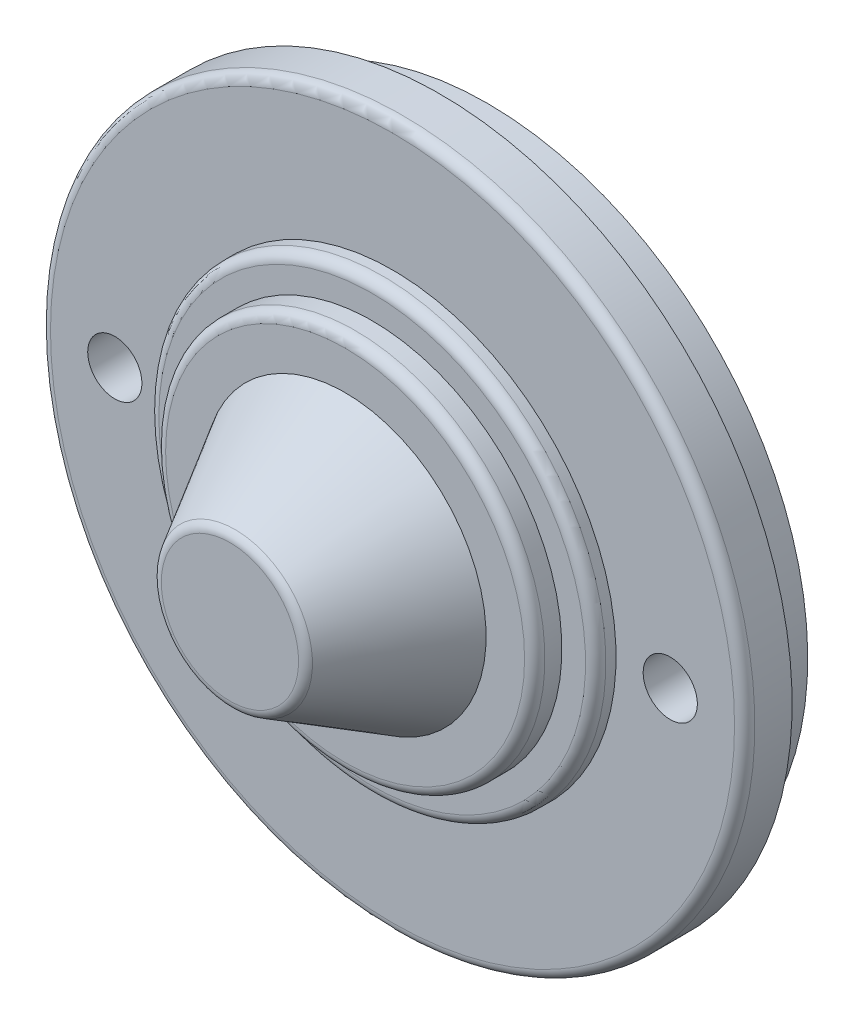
ISO-10303-21;
HEADER;
FILE_DESCRIPTION(('STEP AP214'),'2;1');
FILE_NAME('part.step','',(''),(''),'','','');
FILE_SCHEMA(('AUTOMOTIVE_DESIGN { 1 0 10303 214 1 1 1 1 }'));
ENDSEC;
DATA;
#1=APPLICATION_CONTEXT('core data for automotive mechanical design processes');
#2=APPLICATION_PROTOCOL_DEFINITION('international standard','automotive_design',2000,#1);
#3=PRODUCT_CONTEXT('',#1,'mechanical');
#4=PRODUCT('Part','Part','',(#3));
#5=PRODUCT_RELATED_PRODUCT_CATEGORY('part','',(#4));
#6=PRODUCT_DEFINITION_FORMATION('','',#4);
#7=PRODUCT_DEFINITION_CONTEXT('part definition',#1,'design');
#8=PRODUCT_DEFINITION('design','',#6,#7);
#9=PRODUCT_DEFINITION_SHAPE('','',#8);
#10=(LENGTH_UNIT() NAMED_UNIT(*) SI_UNIT(.MILLI.,.METRE.));
#11=(NAMED_UNIT(*) PLANE_ANGLE_UNIT() SI_UNIT($,.RADIAN.));
#12=(NAMED_UNIT(*) SI_UNIT($,.STERADIAN.) SOLID_ANGLE_UNIT());
#13=UNCERTAINTY_MEASURE_WITH_UNIT(LENGTH_MEASURE(1.E-05),#10,'distance_accuracy_value','');
#14=(GEOMETRIC_REPRESENTATION_CONTEXT(3) GLOBAL_UNCERTAINTY_ASSIGNED_CONTEXT((#13)) GLOBAL_UNIT_ASSIGNED_CONTEXT((#10,
#11,#12)) REPRESENTATION_CONTEXT('',''));
#15=CARTESIAN_POINT('',(0.,0.,0.));
#16=DIRECTION('',(0.,0.,1.));
#17=DIRECTION('',(1.,0.,0.));
#18=AXIS2_PLACEMENT_3D('',#15,#16,#17);
#19=CARTESIAN_POINT('',(0.,23.6383654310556,-29.0601226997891));
#20=DIRECTION('',(0.,0.,-1.));
#21=DIRECTION('',(-1.,0.,0.));
#22=AXIS2_PLACEMENT_3D('',#19,#20,#21);
#23=CYLINDRICAL_SURFACE('',#22,21.9500000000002);
#24=CARTESIAN_POINT('',(0.,23.6383654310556,-8.13632677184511));
#25=DIRECTION('',(0.,0.,-1.));
#26=DIRECTION('',(-1.,0.,0.));
#27=AXIS2_PLACEMENT_3D('',#24,#25,#26);
#28=CIRCLE('',#27,21.9500000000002);
#29=CARTESIAN_POINT('',(-21.7817682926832,26.3507573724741,-8.13632677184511));
#30=VERTEX_POINT('',#29);
#31=CARTESIAN_POINT('',(-21.6696573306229,27.1352856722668,-8.13632677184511));
#32=VERTEX_POINT('',#31);
#33=EDGE_CURVE('E155',#30,#32,#28,.T.);
#34=ORIENTED_EDGE('',*,*,#33,.T.);
#35=DIRECTION('',(0.,0.,-1.));
#36=VECTOR('',#35,1.);
#37=CARTESIAN_POINT('',(-21.6696573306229,27.1352856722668,-4.63632677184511));
#38=LINE('',#37,#36);
#39=CARTESIAN_POINT('',(-21.6696573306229,27.1352856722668,-4.63632677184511));
#40=VERTEX_POINT('',#39);
#41=EDGE_CURVE('E328',#40,#32,#38,.T.);
#42=ORIENTED_EDGE('',*,*,#41,.F.);
#43=CARTESIAN_POINT('',(0.,23.6383654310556,-4.63632677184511));
#44=DIRECTION('',(0.,0.,-1.));
#45=DIRECTION('',(-1.,0.,0.));
#46=AXIS2_PLACEMENT_3D('',#43,#44,#45);
#47=CIRCLE('',#46,21.9500000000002);
#48=CARTESIAN_POINT('',(-21.7817682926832,26.3507573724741,-4.63632677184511));
#49=VERTEX_POINT('',#48);
#50=EDGE_CURVE('E159',#49,#40,#47,.T.);
#51=ORIENTED_EDGE('',*,*,#50,.F.);
#52=DIRECTION('',(0.,0.,1.));
#53=VECTOR('',#52,1.);
#54=CARTESIAN_POINT('',(-21.7817682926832,26.3507573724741,-6.38632677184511));
#55=LINE('',#54,#53);
#56=EDGE_CURVE('E11',#30,#49,#55,.T.);
#57=ORIENTED_EDGE('',*,*,#56,.F.);
#58=EDGE_LOOP('',(#34,#42,#51,#57));
#59=FACE_BOUND('',#58,.T.);
#60=ADVANCED_FACE('F29',(#59),#23,.F.);
#61=DIRECTION('',(0.,0.,1.));
#62=VECTOR('',#61,1.);
#63=CARTESIAN_POINT('',(21.7817682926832,20.9259734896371,-6.38632677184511));
#64=LINE('',#63,#62);
#65=CARTESIAN_POINT('',(21.7817682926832,20.9259734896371,-8.13632677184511));
#66=VERTEX_POINT('',#65);
#67=CARTESIAN_POINT('',(21.7817682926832,20.9259734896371,-4.63632677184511));
#68=VERTEX_POINT('',#67);
#69=EDGE_CURVE('E145',#66,#68,#64,.T.);
#70=ORIENTED_EDGE('',*,*,#69,.F.);
#71=CARTESIAN_POINT('',(-21.7817682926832,20.9259734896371,-8.13632677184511));
#72=VERTEX_POINT('',#71);
#73=EDGE_CURVE('E154',#66,#72,#28,.T.);
#74=ORIENTED_EDGE('',*,*,#73,.T.);
#75=DIRECTION('',(0.,0.,1.));
#76=VECTOR('',#75,1.);
#77=CARTESIAN_POINT('',(-21.7817682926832,20.9259734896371,-6.38632677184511));
#78=LINE('',#77,#76);
#79=CARTESIAN_POINT('',(-21.7817682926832,20.9259734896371,-4.63632677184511));
#80=VERTEX_POINT('',#79);
#81=EDGE_CURVE('E38',#80,#72,#78,.F.);
#82=ORIENTED_EDGE('',*,*,#81,.F.);
#83=EDGE_CURVE('E158',#68,#80,#47,.T.);
#84=ORIENTED_EDGE('',*,*,#83,.F.);
#85=EDGE_LOOP('',(#70,#74,#82,#84));
#86=FACE_BOUND('',#85,.T.);
#87=ADVANCED_FACE('F302',(#86),#23,.F.);
#88=CARTESIAN_POINT('',(-20.020052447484,32.6383654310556,-4.63632677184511));
#89=VERTEX_POINT('',#88);
#90=CARTESIAN_POINT('',(21.7817682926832,26.3507573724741,-4.63632677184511));
#91=VERTEX_POINT('',#90);
#92=EDGE_CURVE('E162',#89,#91,#47,.T.);
#93=ORIENTED_EDGE('',*,*,#92,.F.);
#94=DIRECTION('',(0.,0.,-1.));
#95=VECTOR('',#94,1.);
#96=CARTESIAN_POINT('',(-20.020052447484,32.6383654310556,-4.63632677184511));
#97=LINE('',#96,#95);
#98=CARTESIAN_POINT('',(-20.020052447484,32.6383654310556,-8.13632677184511));
#99=VERTEX_POINT('',#98);
#100=EDGE_CURVE('E105',#89,#99,#97,.T.);
#101=ORIENTED_EDGE('',*,*,#100,.T.);
#102=CARTESIAN_POINT('',(21.7817682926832,26.3507573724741,-8.13632677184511));
#103=VERTEX_POINT('',#102);
#104=EDGE_CURVE('E113',#99,#103,#28,.T.);
#105=ORIENTED_EDGE('',*,*,#104,.T.);
#106=DIRECTION('',(0.,0.,1.));
#107=VECTOR('',#106,1.);
#108=CARTESIAN_POINT('',(21.7817682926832,26.3507573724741,-6.38632677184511));
#109=LINE('',#108,#107);
#110=EDGE_CURVE('E142',#91,#103,#109,.F.);
#111=ORIENTED_EDGE('',*,*,#110,.F.);
#112=EDGE_LOOP('',(#93,#101,#105,#111));
#113=FACE_BOUND('',#112,.T.);
#114=ADVANCED_FACE('F305',(#113),#23,.F.);
#115=CARTESIAN_POINT('',(0.,47.2883654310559,-8.13632677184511));
#116=DIRECTION('',(0.,0.,1.));
#117=DIRECTION('',(1.,0.,0.));
#118=AXIS2_PLACEMENT_3D('',#115,#116,#117);
#119=PLANE('',#118);
#120=CARTESIAN_POINT('',(20.5,23.6383654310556,-8.13632677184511));
#121=DIRECTION('',(0.,0.,-1.));
#122=DIRECTION('',(-1.,0.,0.));
#123=AXIS2_PLACEMENT_3D('',#120,#121,#122);
#124=CIRCLE('',#123,2.00000000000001);
#125=CARTESIAN_POINT('',(18.5,23.6383654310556,-8.13632677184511));
#126=VERTEX_POINT('',#125);
#127=EDGE_CURVE('E138',#126,#126,#124,.T.);
#128=ORIENTED_EDGE('',*,*,#127,.F.);
#129=EDGE_LOOP('',(#128));
#130=FACE_BOUND('',#129,.T.);
#131=CARTESIAN_POINT('',(-20.5,23.6383654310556,-8.13632677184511));
#132=DIRECTION('',(0.,0.,-1.));
#133=DIRECTION('',(-1.,0.,0.));
#134=AXIS2_PLACEMENT_3D('',#131,#132,#133);
#135=CIRCLE('',#134,2.);
#136=CARTESIAN_POINT('',(-22.5,23.6383654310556,-8.13632677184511));
#137=VERTEX_POINT('',#136);
#138=EDGE_CURVE('E128',#137,#137,#135,.T.);
#139=ORIENTED_EDGE('',*,*,#138,.F.);
#140=EDGE_LOOP('',(#139));
#141=FACE_BOUND('',#140,.T.);
#142=CARTESIAN_POINT('',(0.,23.6383654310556,-8.13632677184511));
#143=DIRECTION('',(0.,0.,-1.));
#144=DIRECTION('',(-1.,0.,0.));
#145=AXIS2_PLACEMENT_3D('',#142,#143,#144);
#146=CIRCLE('',#145,23.6500000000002);
#147=CARTESIAN_POINT('',(-21.8705852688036,32.6383654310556,-8.13632677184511));
#148=VERTEX_POINT('',#147);
#149=CARTESIAN_POINT('',(-23.3092792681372,27.6383654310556,-8.13632677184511));
#150=VERTEX_POINT('',#149);
#151=EDGE_CURVE('E111',#148,#150,#146,.T.);
#152=ORIENTED_EDGE('',*,*,#151,.T.);
#153=DIRECTION('',(-0.956011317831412,0.293329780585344,0.));
#154=VECTOR('',#153,1.);
#155=CARTESIAN_POINT('',(-23.3092792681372,27.6383654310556,-8.13632677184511));
#156=LINE('',#155,#154);
#157=EDGE_CURVE('E114',#32,#150,#156,.T.);
#158=ORIENTED_EDGE('',*,*,#157,.F.);
#159=ORIENTED_EDGE('',*,*,#33,.F.);
#160=CARTESIAN_POINT('',(-20.5,23.6383654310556,-8.13632677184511));
#161=DIRECTION('',(0.,0.,-1.));
#162=DIRECTION('',(-1.,0.,0.));
#163=AXIS2_PLACEMENT_3D('',#160,#161,#162);
#164=CIRCLE('',#163,3.);
#165=EDGE_CURVE('E151',#30,#72,#164,.T.);
#166=ORIENTED_EDGE('',*,*,#165,.T.);
#167=ORIENTED_EDGE('',*,*,#73,.F.);
#168=CARTESIAN_POINT('',(20.5,23.6383654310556,-8.13632677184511));
#169=DIRECTION('',(0.,0.,-1.));
#170=DIRECTION('',(-1.,0.,0.));
#171=AXIS2_PLACEMENT_3D('',#168,#169,#170);
#172=CIRCLE('',#171,2.99999999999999);
#173=EDGE_CURVE('E131',#66,#103,#172,.T.);
#174=ORIENTED_EDGE('',*,*,#173,.T.);
#175=ORIENTED_EDGE('',*,*,#104,.F.);
#176=DIRECTION('',(1.,0.,0.));
#177=VECTOR('',#176,1.);
#178=CARTESIAN_POINT('',(-21.8705852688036,32.6383654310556,-8.13632677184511));
#179=LINE('',#178,#177);
#180=EDGE_CURVE('E98',#148,#99,#179,.T.);
#181=ORIENTED_EDGE('',*,*,#180,.F.);
#182=EDGE_LOOP('',(#152,#158,#159,#166,#167,#174,#175,#181));
#183=FACE_BOUND('',#182,.T.);
#184=ADVANCED_FACE('F31',(#130,#141,#183),#119,.F.);
#185=CARTESIAN_POINT('',(0.,23.6383654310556,-29.0601226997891));
#186=DIRECTION('',(0.,0.,-1.));
#187=DIRECTION('',(-1.,0.,0.));
#188=AXIS2_PLACEMENT_3D('',#185,#186,#187);
#189=CYLINDRICAL_SURFACE('',#188,23.6500000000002);
#190=CARTESIAN_POINT('',(0.,23.6383654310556,-4.63632677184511));
#191=DIRECTION('',(0.,0.,-1.));
#192=DIRECTION('',(-1.,0.,0.));
#193=AXIS2_PLACEMENT_3D('',#190,#191,#192);
#194=CIRCLE('',#193,23.6500000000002);
#195=CARTESIAN_POINT('',(-21.8705852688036,32.6383654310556,-4.63632677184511));
#196=VERTEX_POINT('',#195);
#197=CARTESIAN_POINT('',(-23.3092792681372,27.6383654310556,-4.63632677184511));
#198=VERTEX_POINT('',#197);
#199=EDGE_CURVE('E119',#196,#198,#194,.T.);
#200=ORIENTED_EDGE('',*,*,#199,.T.);
#201=DIRECTION('',(0.,0.,-1.));
#202=VECTOR('',#201,1.);
#203=CARTESIAN_POINT('',(-23.3092792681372,27.6383654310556,-4.63632677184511));
#204=LINE('',#203,#202);
#205=EDGE_CURVE('E118',#198,#150,#204,.T.);
#206=ORIENTED_EDGE('',*,*,#205,.T.);
#207=ORIENTED_EDGE('',*,*,#151,.F.);
#208=DIRECTION('',(0.,0.,-1.));
#209=VECTOR('',#208,1.);
#210=CARTESIAN_POINT('',(-21.8705852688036,32.6383654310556,-4.63632677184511));
#211=LINE('',#210,#209);
#212=EDGE_CURVE('E95',#196,#148,#211,.T.);
#213=ORIENTED_EDGE('',*,*,#212,.F.);
#214=EDGE_LOOP('',(#200,#206,#207,#213));
#215=FACE_BOUND('',#214,.T.);
#216=ADVANCED_FACE('F117',(#215),#189,.T.);
#217=CARTESIAN_POINT('',(0.,47.2883654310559,-4.63632677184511));
#218=DIRECTION('',(0.,0.,1.));
#219=DIRECTION('',(1.,0.,0.));
#220=AXIS2_PLACEMENT_3D('',#217,#218,#219);
#221=PLANE('',#220);
#222=ORIENTED_EDGE('',*,*,#199,.F.);
#223=DIRECTION('',(1.,0.,0.));
#224=VECTOR('',#223,1.);
#225=CARTESIAN_POINT('',(-21.8705852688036,32.6383654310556,-4.63632677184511));
#226=LINE('',#225,#224);
#227=EDGE_CURVE('E101',#196,#89,#226,.T.);
#228=ORIENTED_EDGE('',*,*,#227,.T.);
#229=ORIENTED_EDGE('',*,*,#92,.T.);
#230=CARTESIAN_POINT('',(20.5,23.6383654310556,-4.63632677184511));
#231=DIRECTION('',(0.,0.,-1.));
#232=DIRECTION('',(-1.,0.,0.));
#233=AXIS2_PLACEMENT_3D('',#230,#231,#232);
#234=CIRCLE('',#233,2.99999999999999);
#235=EDGE_CURVE('E53',#68,#91,#234,.T.);
#236=ORIENTED_EDGE('',*,*,#235,.F.);
#237=ORIENTED_EDGE('',*,*,#83,.T.);
#238=CARTESIAN_POINT('',(-20.5,23.6383654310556,-4.63632677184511));
#239=DIRECTION('',(0.,0.,-1.));
#240=DIRECTION('',(-1.,0.,0.));
#241=AXIS2_PLACEMENT_3D('',#238,#239,#240);
#242=CIRCLE('',#241,3.);
#243=EDGE_CURVE('E148',#49,#80,#242,.T.);
#244=ORIENTED_EDGE('',*,*,#243,.F.);
#245=ORIENTED_EDGE('',*,*,#50,.T.);
#246=DIRECTION('',(-0.956011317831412,0.293329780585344,0.));
#247=VECTOR('',#246,1.);
#248=CARTESIAN_POINT('',(-23.3092792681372,27.6383654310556,-4.63632677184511));
#249=LINE('',#248,#247);
#250=EDGE_CURVE('E46',#40,#198,#249,.T.);
#251=ORIENTED_EDGE('',*,*,#250,.T.);
#252=EDGE_LOOP('',(#222,#228,#229,#236,#237,#244,#245,#251));
#253=FACE_BOUND('',#252,.T.);
#254=CARTESIAN_POINT('',(0.,23.6383654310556,-4.63632677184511));
#255=DIRECTION('',(0.,0.,-1.));
#256=DIRECTION('',(-1.,0.,0.));
#257=AXIS2_PLACEMENT_3D('',#254,#255,#256);
#258=CIRCLE('',#257,25.9980881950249);
#259=CARTESIAN_POINT('',(-25.9980881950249,23.6383654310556,-4.63632677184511));
#260=VERTEX_POINT('',#259);
#261=EDGE_CURVE('E123',#260,#260,#258,.T.);
#262=ORIENTED_EDGE('',*,*,#261,.T.);
#263=EDGE_LOOP('',(#262));
#264=FACE_BOUND('',#263,.T.);
#265=CARTESIAN_POINT('',(0.,23.6383654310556,-4.63632677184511));
#266=DIRECTION('',(0.,0.,-1.));
#267=DIRECTION('',(-1.,0.,0.));
#268=AXIS2_PLACEMENT_3D('',#265,#266,#267);
#269=CIRCLE('',#268,16.);
#270=CARTESIAN_POINT('',(-16.,23.6383654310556,-4.63632677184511));
#271=VERTEX_POINT('',#270);
#272=EDGE_CURVE('E161',#271,#271,#269,.T.);
#273=ORIENTED_EDGE('',*,*,#272,.F.);
#274=EDGE_LOOP('',(#273));
#275=FACE_BOUND('',#274,.T.);
#276=ADVANCED_FACE('F221',(#253,#264,#275),#221,.F.);
#277=CARTESIAN_POINT('',(0.,23.6383654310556,-29.0601226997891));
#278=DIRECTION('',(0.,0.,-1.));
#279=DIRECTION('',(-1.,0.,0.));
#280=AXIS2_PLACEMENT_3D('',#277,#278,#279);
#281=CYLINDRICAL_SURFACE('',#280,25.9980881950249);
#282=ORIENTED_EDGE('',*,*,#261,.F.);
#283=EDGE_LOOP('',(#282));
#284=FACE_BOUND('',#283,.T.);
#285=CARTESIAN_POINT('',(0.,23.6383654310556,-1.88632677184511));
#286=DIRECTION('',(0.,0.,-1.));
#287=DIRECTION('',(-1.,0.,0.));
#288=AXIS2_PLACEMENT_3D('',#285,#286,#287);
#289=CIRCLE('',#288,25.9980881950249);
#290=CARTESIAN_POINT('',(-25.9980881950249,23.6383654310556,-1.88632677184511));
#291=VERTEX_POINT('',#290);
#292=EDGE_CURVE('E216',#291,#291,#289,.T.);
#293=ORIENTED_EDGE('',*,*,#292,.T.);
#294=EDGE_LOOP('',(#293));
#295=FACE_BOUND('',#294,.T.);
#296=ADVANCED_FACE('F224',(#284,#295),#281,.T.);
#297=CARTESIAN_POINT('',(0.,23.6383654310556,-1.88632677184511));
#298=DIRECTION('',(0.,0.,-1.));
#299=DIRECTION('',(-1.,0.,0.));
#300=AXIS2_PLACEMENT_3D('',#297,#298,#299);
#301=TOROIDAL_SURFACE('',#300,25.2480881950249,0.749999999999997);
#302=ORIENTED_EDGE('',*,*,#292,.F.);
#303=EDGE_LOOP('',(#302));
#304=FACE_BOUND('',#303,.T.);
#305=CARTESIAN_POINT('',(0.,23.6383654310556,-1.13632677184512));
#306=DIRECTION('',(0.,0.,-1.));
#307=DIRECTION('',(-1.,0.,0.));
#308=AXIS2_PLACEMENT_3D('',#305,#306,#307);
#309=CIRCLE('',#308,25.2480881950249);
#310=CARTESIAN_POINT('',(-25.2480881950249,23.6383654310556,-1.13632677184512));
#311=VERTEX_POINT('',#310);
#312=EDGE_CURVE('E213',#311,#311,#309,.T.);
#313=ORIENTED_EDGE('',*,*,#312,.T.);
#314=EDGE_LOOP('',(#313));
#315=FACE_BOUND('',#314,.T.);
#316=ADVANCED_FACE('F227',(#304,#315),#301,.T.);
#317=CARTESIAN_POINT('',(0.,48.8864536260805,-1.13632677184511));
#318=DIRECTION('',(0.,0.,-1.));
#319=DIRECTION('',(-1.,0.,0.));
#320=AXIS2_PLACEMENT_3D('',#317,#318,#319);
#321=PLANE('',#320);
#322=CARTESIAN_POINT('',(20.5,23.6383654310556,-1.13632677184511));
#323=DIRECTION('',(0.,0.,-1.));
#324=DIRECTION('',(-1.,0.,0.));
#325=AXIS2_PLACEMENT_3D('',#322,#323,#324);
#326=CIRCLE('',#325,2.00000000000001);
#327=CARTESIAN_POINT('',(18.5,23.6383654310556,-1.13632677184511));
#328=VERTEX_POINT('',#327);
#329=EDGE_CURVE('E33',#328,#328,#326,.T.);
#330=ORIENTED_EDGE('',*,*,#329,.T.);
#331=EDGE_LOOP('',(#330));
#332=FACE_BOUND('',#331,.T.);
#333=CARTESIAN_POINT('',(-20.5,23.6383654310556,-1.13632677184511));
#334=DIRECTION('',(0.,0.,-1.));
#335=DIRECTION('',(-1.,0.,0.));
#336=AXIS2_PLACEMENT_3D('',#333,#334,#335);
#337=CIRCLE('',#336,2.);
#338=CARTESIAN_POINT('',(-22.5,23.6383654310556,-1.13632677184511));
#339=VERTEX_POINT('',#338);
#340=EDGE_CURVE('E126',#339,#339,#337,.T.);
#341=ORIENTED_EDGE('',*,*,#340,.T.);
#342=EDGE_LOOP('',(#341));
#343=FACE_BOUND('',#342,.T.);
#344=ORIENTED_EDGE('',*,*,#312,.F.);
#345=EDGE_LOOP('',(#344));
#346=FACE_BOUND('',#345,.T.);
#347=CARTESIAN_POINT('',(0.,23.6383654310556,-1.13632677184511));
#348=DIRECTION('',(0.,0.,-1.));
#349=DIRECTION('',(-1.,0.,0.));
#350=AXIS2_PLACEMENT_3D('',#347,#348,#349);
#351=CIRCLE('',#350,16.5);
#352=CARTESIAN_POINT('',(-16.5,23.6383654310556,-1.13632677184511));
#353=VERTEX_POINT('',#352);
#354=EDGE_CURVE('E210',#353,#353,#351,.T.);
#355=ORIENTED_EDGE('',*,*,#354,.T.);
#356=EDGE_LOOP('',(#355));
#357=FACE_BOUND('',#356,.T.);
#358=ADVANCED_FACE('F233',(#332,#343,#346,#357),#321,.F.);
#359=CARTESIAN_POINT('',(0.,23.6383654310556,-29.0601226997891));
#360=DIRECTION('',(0.,0.,-1.));
#361=DIRECTION('',(-1.,0.,0.));
#362=AXIS2_PLACEMENT_3D('',#359,#360,#361);
#363=CYLINDRICAL_SURFACE('',#362,16.5);
#364=ORIENTED_EDGE('',*,*,#354,.F.);
#365=EDGE_LOOP('',(#364));
#366=FACE_BOUND('',#365,.T.);
#367=CARTESIAN_POINT('',(0.,23.6383654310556,-0.386326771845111));
#368=DIRECTION('',(0.,0.,-1.));
#369=DIRECTION('',(-1.,0.,0.));
#370=AXIS2_PLACEMENT_3D('',#367,#368,#369);
#371=CIRCLE('',#370,16.5);
#372=CARTESIAN_POINT('',(-16.5,23.6383654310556,-0.386326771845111));
#373=VERTEX_POINT('',#372);
#374=EDGE_CURVE('E207',#373,#373,#371,.T.);
#375=ORIENTED_EDGE('',*,*,#374,.T.);
#376=EDGE_LOOP('',(#375));
#377=FACE_BOUND('',#376,.T.);
#378=ADVANCED_FACE('F239',(#366,#377),#363,.T.);
#379=CARTESIAN_POINT('',(0.,23.6383654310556,-0.386326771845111));
#380=DIRECTION('',(0.,0.,-1.));
#381=DIRECTION('',(-1.,0.,0.));
#382=AXIS2_PLACEMENT_3D('',#379,#380,#381);
#383=TOROIDAL_SURFACE('',#382,15.75,0.75);
#384=ORIENTED_EDGE('',*,*,#374,.F.);
#385=EDGE_LOOP('',(#384));
#386=FACE_BOUND('',#385,.T.);
#387=CARTESIAN_POINT('',(0.,23.6383654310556,0.363673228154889));
#388=DIRECTION('',(0.,0.,-1.));
#389=DIRECTION('',(-1.,0.,0.));
#390=AXIS2_PLACEMENT_3D('',#387,#388,#389);
#391=CIRCLE('',#390,15.75);
#392=CARTESIAN_POINT('',(-15.75,23.6383654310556,0.363673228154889));
#393=VERTEX_POINT('',#392);
#394=EDGE_CURVE('E204',#393,#393,#391,.T.);
#395=ORIENTED_EDGE('',*,*,#394,.T.);
#396=EDGE_LOOP('',(#395));
#397=FACE_BOUND('',#396,.T.);
#398=ADVANCED_FACE('F246',(#386,#397),#383,.T.);
#399=CARTESIAN_POINT('',(0.,39.3883654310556,0.36367322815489));
#400=DIRECTION('',(0.,0.,-1.));
#401=DIRECTION('',(-1.,0.,0.));
#402=AXIS2_PLACEMENT_3D('',#399,#400,#401);
#403=PLANE('',#402);
#404=ORIENTED_EDGE('',*,*,#394,.F.);
#405=EDGE_LOOP('',(#404));
#406=FACE_BOUND('',#405,.T.);
#407=CARTESIAN_POINT('',(0.,23.6383654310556,0.363673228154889));
#408=DIRECTION('',(0.,0.,-1.));
#409=DIRECTION('',(-1.,0.,0.));
#410=AXIS2_PLACEMENT_3D('',#407,#408,#409);
#411=CIRCLE('',#410,14.);
#412=CARTESIAN_POINT('',(-14.,23.6383654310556,0.363673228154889));
#413=VERTEX_POINT('',#412);
#414=EDGE_CURVE('E201',#413,#413,#411,.T.);
#415=ORIENTED_EDGE('',*,*,#414,.T.);
#416=EDGE_LOOP('',(#415));
#417=FACE_BOUND('',#416,.T.);
#418=ADVANCED_FACE('F252',(#406,#417),#403,.F.);
#419=CARTESIAN_POINT('',(0.,23.6383654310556,-29.0601226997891));
#420=DIRECTION('',(0.,0.,-1.));
#421=DIRECTION('',(-1.,0.,0.));
#422=AXIS2_PLACEMENT_3D('',#419,#420,#421);
#423=CYLINDRICAL_SURFACE('',#422,14.);
#424=ORIENTED_EDGE('',*,*,#414,.F.);
#425=EDGE_LOOP('',(#424));
#426=FACE_BOUND('',#425,.T.);
#427=CARTESIAN_POINT('',(0.,23.6383654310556,1.61367322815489));
#428=DIRECTION('',(0.,0.,-1.));
#429=DIRECTION('',(-1.,0.,0.));
#430=AXIS2_PLACEMENT_3D('',#427,#428,#429);
#431=CIRCLE('',#430,14.);
#432=CARTESIAN_POINT('',(-14.,23.6383654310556,1.61367322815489));
#433=VERTEX_POINT('',#432);
#434=EDGE_CURVE('E198',#433,#433,#431,.T.);
#435=ORIENTED_EDGE('',*,*,#434,.T.);
#436=EDGE_LOOP('',(#435));
#437=FACE_BOUND('',#436,.T.);
#438=ADVANCED_FACE('F258',(#426,#437),#423,.T.);
#439=CARTESIAN_POINT('',(0.,23.6383654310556,1.61367322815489));
#440=DIRECTION('',(0.,0.,-1.));
#441=DIRECTION('',(-1.,0.,0.));
#442=AXIS2_PLACEMENT_3D('',#439,#440,#441);
#443=TOROIDAL_SURFACE('',#442,13.25,0.749999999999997);
#444=ORIENTED_EDGE('',*,*,#434,.F.);
#445=EDGE_LOOP('',(#444));
#446=FACE_BOUND('',#445,.T.);
#447=CARTESIAN_POINT('',(0.,23.6383654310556,2.36367322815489));
#448=DIRECTION('',(0.,0.,-1.));
#449=DIRECTION('',(-1.,0.,0.));
#450=AXIS2_PLACEMENT_3D('',#447,#448,#449);
#451=CIRCLE('',#450,13.25);
#452=CARTESIAN_POINT('',(-13.25,23.6383654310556,2.36367322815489));
#453=VERTEX_POINT('',#452);
#454=EDGE_CURVE('E195',#453,#453,#451,.T.);
#455=ORIENTED_EDGE('',*,*,#454,.T.);
#456=EDGE_LOOP('',(#455));
#457=FACE_BOUND('',#456,.T.);
#458=ADVANCED_FACE('F264',(#446,#457),#443,.T.);
#459=CARTESIAN_POINT('',(0.,36.8883654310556,2.36367322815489));
#460=DIRECTION('',(0.,0.,-1.));
#461=DIRECTION('',(-1.,0.,0.));
#462=AXIS2_PLACEMENT_3D('',#459,#460,#461);
#463=PLANE('',#462);
#464=ORIENTED_EDGE('',*,*,#454,.F.);
#465=EDGE_LOOP('',(#464));
#466=FACE_BOUND('',#465,.T.);
#467=CARTESIAN_POINT('',(0.,23.6383654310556,2.36367322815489));
#468=DIRECTION('',(0.,0.,-1.));
#469=DIRECTION('',(-1.,0.,0.));
#470=AXIS2_PLACEMENT_3D('',#467,#468,#469);
#471=CIRCLE('',#470,10.4074772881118);
#472=CARTESIAN_POINT('',(-10.4074772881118,23.6383654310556,2.36367322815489));
#473=VERTEX_POINT('',#472);
#474=EDGE_CURVE('E192',#473,#473,#471,.T.);
#475=ORIENTED_EDGE('',*,*,#474,.T.);
#476=EDGE_LOOP('',(#475));
#477=FACE_BOUND('',#476,.T.);
#478=ADVANCED_FACE('F270',(#466,#477),#463,.F.);
#479=CARTESIAN_POINT('',(0.,23.6383654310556,10.4886732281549));
#480=DIRECTION('',(0.,0.,-1.));
#481=DIRECTION('',(-1.,0.,0.));
#482=AXIS2_PLACEMENT_3D('',#479,#480,#481);
#483=CONICAL_SURFACE('',#482,5.71650635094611,0.5235987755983);
#484=ORIENTED_EDGE('',*,*,#474,.F.);
#485=EDGE_LOOP('',(#484));
#486=FACE_BOUND('',#485,.T.);
#487=CARTESIAN_POINT('',(0.,23.6383654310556,10.4886732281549));
#488=DIRECTION('',(0.,0.,-1.));
#489=DIRECTION('',(-1.,0.,0.));
#490=AXIS2_PLACEMENT_3D('',#487,#488,#489);
#491=CIRCLE('',#490,5.71650635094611);
#492=CARTESIAN_POINT('',(-5.71650635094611,23.6383654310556,10.4886732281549));
#493=VERTEX_POINT('',#492);
#494=EDGE_CURVE('E189',#493,#493,#491,.T.);
#495=ORIENTED_EDGE('',*,*,#494,.T.);
#496=EDGE_LOOP('',(#495));
#497=FACE_BOUND('',#496,.T.);
#498=ADVANCED_FACE('F276',(#486,#497),#483,.T.);
#499=CARTESIAN_POINT('',(0.,23.6383654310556,10.1136732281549));
#500=DIRECTION('',(0.,0.,-1.));
#501=DIRECTION('',(-1.,0.,0.));
#502=AXIS2_PLACEMENT_3D('',#499,#500,#501);
#503=TOROIDAL_SURFACE('',#502,5.06698729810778,0.749999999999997);
#504=ORIENTED_EDGE('',*,*,#494,.F.);
#505=EDGE_LOOP('',(#504));
#506=FACE_BOUND('',#505,.T.);
#507=CARTESIAN_POINT('',(0.,23.6383654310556,10.8636732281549));
#508=DIRECTION('',(0.,0.,-1.));
#509=DIRECTION('',(-1.,0.,0.));
#510=AXIS2_PLACEMENT_3D('',#507,#508,#509);
#511=CIRCLE('',#510,5.06698729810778);
#512=CARTESIAN_POINT('',(-5.06698729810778,23.6383654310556,10.8636732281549));
#513=VERTEX_POINT('',#512);
#514=EDGE_CURVE('E186',#513,#513,#511,.T.);
#515=ORIENTED_EDGE('',*,*,#514,.T.);
#516=EDGE_LOOP('',(#515));
#517=FACE_BOUND('',#516,.T.);
#518=ADVANCED_FACE('F282',(#506,#517),#503,.T.);
#519=CARTESIAN_POINT('',(0.,28.7053527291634,10.8636732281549));
#520=DIRECTION('',(0.,0.,-1.));
#521=DIRECTION('',(-1.,0.,0.));
#522=AXIS2_PLACEMENT_3D('',#519,#520,#521);
#523=PLANE('',#522);
#524=ORIENTED_EDGE('',*,*,#514,.F.);
#525=EDGE_LOOP('',(#524));
#526=FACE_BOUND('',#525,.T.);
#527=ADVANCED_FACE('F288',(#526),#523,.F.);
#528=CARTESIAN_POINT('',(0.,27.9063146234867,8.56367322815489));
#529=DIRECTION('',(0.,0.,1.));
#530=DIRECTION('',(1.,0.,0.));
#531=AXIS2_PLACEMENT_3D('',#528,#529,#530);
#532=PLANE('',#531);
#533=CARTESIAN_POINT('',(0.,23.6383654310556,8.56367322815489));
#534=DIRECTION('',(0.,0.,-1.));
#535=DIRECTION('',(-1.,0.,0.));
#536=AXIS2_PLACEMENT_3D('',#533,#534,#535);
#537=CIRCLE('',#536,4.26794919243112);
#538=CARTESIAN_POINT('',(-4.26794919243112,23.6383654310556,8.56367322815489));
#539=VERTEX_POINT('',#538);
#540=EDGE_CURVE('E183',#539,#539,#537,.T.);
#541=ORIENTED_EDGE('',*,*,#540,.T.);
#542=EDGE_LOOP('',(#541));
#543=FACE_BOUND('',#542,.T.);
#544=ADVANCED_FACE('F293',(#543),#532,.F.);
#545=CARTESIAN_POINT('',(0.,23.6383654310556,5.56367322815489));
#546=DIRECTION('',(0.,0.,-1.));
#547=DIRECTION('',(-1.,0.,0.));
#548=AXIS2_PLACEMENT_3D('',#545,#546,#547);
#549=CONICAL_SURFACE('',#548,6.,0.5235987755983);
#550=ORIENTED_EDGE('',*,*,#540,.F.);
#551=EDGE_LOOP('',(#550));
#552=FACE_BOUND('',#551,.T.);
#553=CARTESIAN_POINT('',(0.,23.6383654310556,5.56367322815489));
#554=DIRECTION('',(0.,0.,-1.));
#555=DIRECTION('',(-1.,0.,0.));
#556=AXIS2_PLACEMENT_3D('',#553,#554,#555);
#557=CIRCLE('',#556,6.);
#558=CARTESIAN_POINT('',(-6.,23.6383654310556,5.56367322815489));
#559=VERTEX_POINT('',#558);
#560=EDGE_CURVE('E180',#559,#559,#557,.T.);
#561=ORIENTED_EDGE('',*,*,#560,.T.);
#562=EDGE_LOOP('',(#561));
#563=FACE_BOUND('',#562,.T.);
#564=ADVANCED_FACE('F298',(#552,#563),#549,.F.);
#565=CARTESIAN_POINT('',(0.,23.6383654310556,-29.0601226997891));
#566=DIRECTION('',(0.,0.,-1.));
#567=DIRECTION('',(-1.,0.,0.));
#568=AXIS2_PLACEMENT_3D('',#565,#566,#567);
#569=CYLINDRICAL_SURFACE('',#568,6.);
#570=ORIENTED_EDGE('',*,*,#560,.F.);
#571=EDGE_LOOP('',(#570));
#572=FACE_BOUND('',#571,.T.);
#573=CARTESIAN_POINT('',(0.,23.6383654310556,-3.43632677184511));
#574=DIRECTION('',(0.,0.,-1.));
#575=DIRECTION('',(-1.,0.,0.));
#576=AXIS2_PLACEMENT_3D('',#573,#574,#575);
#577=CIRCLE('',#576,6.);
#578=CARTESIAN_POINT('',(-6.,23.6383654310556,-3.43632677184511));
#579=VERTEX_POINT('',#578);
#580=EDGE_CURVE('E177',#579,#579,#577,.T.);
#581=ORIENTED_EDGE('',*,*,#580,.T.);
#582=EDGE_LOOP('',(#581));
#583=FACE_BOUND('',#582,.T.);
#584=ADVANCED_FACE('F470',(#572,#583),#569,.F.);
#585=CARTESIAN_POINT('',(0.,37.1383654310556,-3.43632677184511));
#586=DIRECTION('',(0.,0.,1.));
#587=DIRECTION('',(1.,0.,0.));
#588=AXIS2_PLACEMENT_3D('',#585,#586,#587);
#589=PLANE('',#588);
#590=ORIENTED_EDGE('',*,*,#580,.F.);
#591=EDGE_LOOP('',(#590));
#592=FACE_BOUND('',#591,.T.);
#593=CARTESIAN_POINT('',(0.,23.6383654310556,-3.43632677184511));
#594=DIRECTION('',(0.,0.,-1.));
#595=DIRECTION('',(-1.,0.,0.));
#596=AXIS2_PLACEMENT_3D('',#593,#594,#595);
#597=CIRCLE('',#596,13.5);
#598=CARTESIAN_POINT('',(-13.5,23.6383654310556,-3.43632677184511));
#599=VERTEX_POINT('',#598);
#600=EDGE_CURVE('E174',#599,#599,#597,.T.);
#601=ORIENTED_EDGE('',*,*,#600,.T.);
#602=EDGE_LOOP('',(#601));
#603=FACE_BOUND('',#602,.T.);
#604=ADVANCED_FACE('F480',(#592,#603),#589,.F.);
#605=CARTESIAN_POINT('',(0.,23.6383654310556,-29.0601226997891));
#606=DIRECTION('',(0.,0.,-1.));
#607=DIRECTION('',(-1.,0.,0.));
#608=AXIS2_PLACEMENT_3D('',#605,#606,#607);
#609=CYLINDRICAL_SURFACE('',#608,13.5);
#610=ORIENTED_EDGE('',*,*,#600,.F.);
#611=EDGE_LOOP('',(#610));
#612=FACE_BOUND('',#611,.T.);
#613=CARTESIAN_POINT('',(0.,23.6383654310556,-6.83632677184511));
#614=DIRECTION('',(0.,0.,-1.));
#615=DIRECTION('',(-1.,0.,0.));
#616=AXIS2_PLACEMENT_3D('',#613,#614,#615);
#617=CIRCLE('',#616,13.5);
#618=CARTESIAN_POINT('',(-13.5,23.6383654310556,-6.83632677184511));
#619=VERTEX_POINT('',#618);
#620=EDGE_CURVE('E171',#619,#619,#617,.T.);
#621=ORIENTED_EDGE('',*,*,#620,.T.);
#622=EDGE_LOOP('',(#621));
#623=FACE_BOUND('',#622,.T.);
#624=ADVANCED_FACE('F490',(#612,#623),#609,.F.);
#625=CARTESIAN_POINT('',(0.,38.8883654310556,-6.83632677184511));
#626=DIRECTION('',(0.,0.,1.));
#627=DIRECTION('',(1.,0.,0.));
#628=AXIS2_PLACEMENT_3D('',#625,#626,#627);
#629=PLANE('',#628);
#630=ORIENTED_EDGE('',*,*,#620,.F.);
#631=EDGE_LOOP('',(#630));
#632=FACE_BOUND('',#631,.T.);
#633=CARTESIAN_POINT('',(0.,23.6383654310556,-6.83632677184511));
#634=DIRECTION('',(0.,0.,-1.));
#635=DIRECTION('',(-1.,0.,0.));
#636=AXIS2_PLACEMENT_3D('',#633,#634,#635);
#637=CIRCLE('',#636,15.25);
#638=CARTESIAN_POINT('',(-15.25,23.6383654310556,-6.83632677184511));
#639=VERTEX_POINT('',#638);
#640=EDGE_CURVE('E168',#639,#639,#637,.T.);
#641=ORIENTED_EDGE('',*,*,#640,.T.);
#642=EDGE_LOOP('',(#641));
#643=FACE_BOUND('',#642,.T.);
#644=ADVANCED_FACE('F500',(#632,#643),#629,.F.);
#645=CARTESIAN_POINT('',(0.,23.6383654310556,-6.08632677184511));
#646=DIRECTION('',(0.,0.,-1.));
#647=DIRECTION('',(-1.,0.,0.));
#648=AXIS2_PLACEMENT_3D('',#645,#646,#647);
#649=TOROIDAL_SURFACE('',#648,15.25,0.75);
#650=ORIENTED_EDGE('',*,*,#640,.F.);
#651=EDGE_LOOP('',(#650));
#652=FACE_BOUND('',#651,.T.);
#653=CARTESIAN_POINT('',(0.,23.6383654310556,-6.08632677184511));
#654=DIRECTION('',(0.,0.,-1.));
#655=DIRECTION('',(-1.,0.,0.));
#656=AXIS2_PLACEMENT_3D('',#653,#654,#655);
#657=CIRCLE('',#656,16.);
#658=CARTESIAN_POINT('',(-16.,23.6383654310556,-6.08632677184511));
#659=VERTEX_POINT('',#658);
#660=EDGE_CURVE('E165',#659,#659,#657,.T.);
#661=ORIENTED_EDGE('',*,*,#660,.T.);
#662=EDGE_LOOP('',(#661));
#663=FACE_BOUND('',#662,.T.);
#664=ADVANCED_FACE('F510',(#652,#663),#649,.T.);
#665=CARTESIAN_POINT('',(0.,23.6383654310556,-29.0601226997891));
#666=DIRECTION('',(0.,0.,-1.));
#667=DIRECTION('',(-1.,0.,0.));
#668=AXIS2_PLACEMENT_3D('',#665,#666,#667);
#669=CYLINDRICAL_SURFACE('',#668,16.);
#670=ORIENTED_EDGE('',*,*,#660,.F.);
#671=EDGE_LOOP('',(#670));
#672=FACE_BOUND('',#671,.T.);
#673=ORIENTED_EDGE('',*,*,#272,.T.);
#674=EDGE_LOOP('',(#673));
#675=FACE_BOUND('',#674,.T.);
#676=ADVANCED_FACE('F349',(#672,#675),#669,.T.);
#677=CARTESIAN_POINT('',(-20.5,23.6383654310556,-8.13632677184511));
#678=DIRECTION('',(0.,0.,1.));
#679=DIRECTION('',(1.,0.,0.));
#680=AXIS2_PLACEMENT_3D('',#677,#678,#679);
#681=CYLINDRICAL_SURFACE('',#680,3.);
#682=ORIENTED_EDGE('',*,*,#165,.F.);
#683=ORIENTED_EDGE('',*,*,#56,.T.);
#684=ORIENTED_EDGE('',*,*,#243,.T.);
#685=ORIENTED_EDGE('',*,*,#81,.T.);
#686=EDGE_LOOP('',(#682,#683,#684,#685));
#687=FACE_BOUND('',#686,.T.);
#688=ADVANCED_FACE('F325',(#687),#681,.T.);
#689=CARTESIAN_POINT('',(20.5,23.6383654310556,-8.13632677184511));
#690=DIRECTION('',(0.,0.,1.));
#691=DIRECTION('',(1.,0.,0.));
#692=AXIS2_PLACEMENT_3D('',#689,#690,#691);
#693=CYLINDRICAL_SURFACE('',#692,2.99999999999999);
#694=ORIENTED_EDGE('',*,*,#173,.F.);
#695=ORIENTED_EDGE('',*,*,#69,.T.);
#696=ORIENTED_EDGE('',*,*,#235,.T.);
#697=ORIENTED_EDGE('',*,*,#110,.T.);
#698=EDGE_LOOP('',(#694,#695,#696,#697));
#699=FACE_BOUND('',#698,.T.);
#700=ADVANCED_FACE('F339',(#699),#693,.T.);
#701=CARTESIAN_POINT('',(-20.5,23.6383654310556,10.8636732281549));
#702=DIRECTION('',(0.,0.,-1.));
#703=DIRECTION('',(-1.,0.,0.));
#704=AXIS2_PLACEMENT_3D('',#701,#702,#703);
#705=CYLINDRICAL_SURFACE('',#704,2.);
#706=ORIENTED_EDGE('',*,*,#138,.T.);
#707=EDGE_LOOP('',(#706));
#708=FACE_BOUND('',#707,.T.);
#709=ORIENTED_EDGE('',*,*,#340,.F.);
#710=EDGE_LOOP('',(#709));
#711=FACE_BOUND('',#710,.T.);
#712=ADVANCED_FACE('F341',(#708,#711),#705,.F.);
#713=CARTESIAN_POINT('',(20.5,23.6383654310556,10.8636732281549));
#714=DIRECTION('',(0.,0.,-1.));
#715=DIRECTION('',(-1.,0.,0.));
#716=AXIS2_PLACEMENT_3D('',#713,#714,#715);
#717=CYLINDRICAL_SURFACE('',#716,2.00000000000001);
#718=ORIENTED_EDGE('',*,*,#127,.T.);
#719=EDGE_LOOP('',(#718));
#720=FACE_BOUND('',#719,.T.);
#721=ORIENTED_EDGE('',*,*,#329,.F.);
#722=EDGE_LOOP('',(#721));
#723=FACE_BOUND('',#722,.T.);
#724=ADVANCED_FACE('F347',(#720,#723),#717,.F.);
#725=CARTESIAN_POINT('',(-23.3092792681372,27.6383654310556,-4.63632677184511));
#726=DIRECTION('',(-0.293329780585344,-0.956011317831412,0.));
#727=DIRECTION('',(0.956011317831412,-0.293329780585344,0.));
#728=AXIS2_PLACEMENT_3D('',#725,#726,#727);
#729=PLANE('',#728);
#730=ORIENTED_EDGE('',*,*,#157,.T.);
#731=ORIENTED_EDGE('',*,*,#205,.F.);
#732=ORIENTED_EDGE('',*,*,#250,.F.);
#733=ORIENTED_EDGE('',*,*,#41,.T.);
#734=EDGE_LOOP('',(#730,#731,#732,#733));
#735=FACE_BOUND('',#734,.T.);
#736=ADVANCED_FACE('F336',(#735),#729,.F.);
#737=CARTESIAN_POINT('',(-21.8705852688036,32.6383654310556,-4.63632677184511));
#738=DIRECTION('',(0.,1.,0.));
#739=DIRECTION('',(0.,0.,1.));
#740=AXIS2_PLACEMENT_3D('',#737,#738,#739);
#741=PLANE('',#740);
#742=ORIENTED_EDGE('',*,*,#180,.T.);
#743=ORIENTED_EDGE('',*,*,#100,.F.);
#744=ORIENTED_EDGE('',*,*,#227,.F.);
#745=ORIENTED_EDGE('',*,*,#212,.T.);
#746=EDGE_LOOP('',(#742,#743,#744,#745));
#747=FACE_BOUND('',#746,.T.);
#748=ADVANCED_FACE('F97',(#747),#741,.F.);
#749=CLOSED_SHELL('',(#60,#87,#114,#184,#216,#276,#296,#316,#358,#378,#398,#418,#438,#458,#478,
#498,#518,#527,#544,#564,#584,#604,#624,#644,#664,#676,#688,#700,#712,#724,#736,#748));
#750=MANIFOLD_SOLID_BREP('B2',#749);
#751=ADVANCED_BREP_SHAPE_REPRESENTATION('',(#18,#750),#14);
#752=SHAPE_DEFINITION_REPRESENTATION(#9,#751);
ENDSEC;
END-ISO-10303-21;
